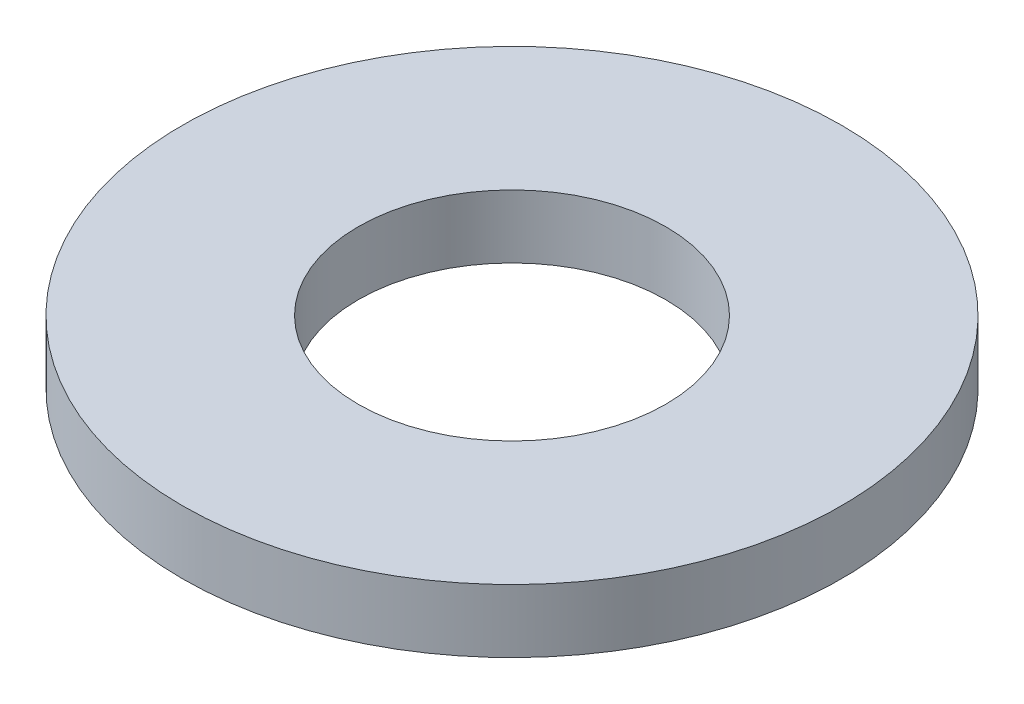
from build123d import *

# Parameters (mm, degrees)
SKETCH1_R           = 4.7625
BOSS_EXTRUDE1_DEPTH = 0.9144
SKETCH5_R           = 2.2225
CUT_EXTRUDE1_DEPTH  = 7.796980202


with BuildPart() as part:
    # Sketch1 → Boss-Extrude1 (new body)
    with BuildSketch(Plane(origin=(0, 0, 0), x_dir=(1, 0, 0), z_dir=(0, 1, 0))):
        with Locations(Location((0, 0, 0), (0, 0, 270))):
            Circle(SKETCH1_R)
    extrude(amount=BOSS_EXTRUDE1_DEPTH)

    # Sketch5 → Cut-Extrude1 (cut, through all)
    with BuildSketch(Plane(origin=(0, 0.9144, 0), x_dir=(-1, 0, 0), z_dir=(0, 1, 0))):
        with Locations(Location((0, 0, 0), (0, 0, 90))):
            Circle(SKETCH5_R)
    extrude(amount=-CUT_EXTRUDE1_DEPTH, mode=Mode.SUBTRACT)


solid = part.part
